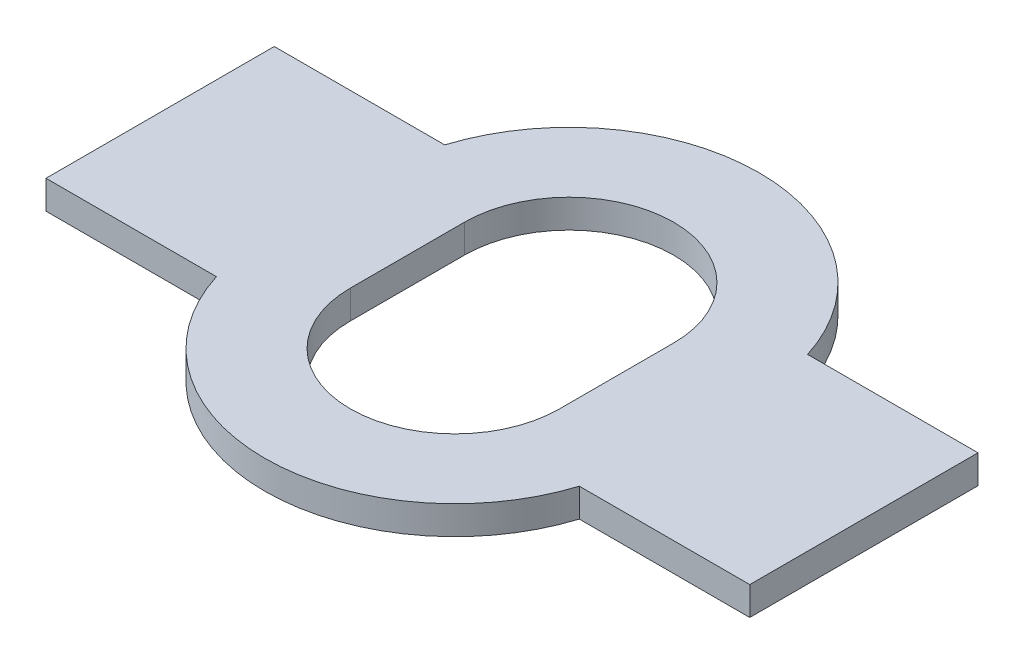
from build123d import *

# Parameters (mm, degrees)
EXTRUDE1_DEPTH = 3


with BuildPart() as part:
    # Sketch1 → Extrude1 (new body)
    with BuildSketch(Plane(origin=(0, 0, 0), x_dir=(1, 0, 0), z_dir=(0, 1, 0))):
        with BuildLine():
            Line((37, 12), (19.078784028, 12))
            ThreePointArc((19.078784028, 12), (0, 26), (-19.078784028, 12))
            Line((-19.078784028, 12), (-37, 12))
            Line((-37, 12), (-37, -12))
            Line((-37, -12), (-19.078784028, -12))
            ThreePointArc((-19.078784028, -12), (0, -26), (19.078784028, -12))
            Line((19.078784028, -12), (37, -12))
            Line((37, -12), (37, 12))
        make_face()
        with BuildLine():
            Line((11, 6), (11, -6))
            ThreePointArc((11, -6), (0, -17), (-11, -6))
            Line((-11, -6), (-11, 6))
            ThreePointArc((-11, 6), (0, 17), (11, 6))
        make_face(mode=Mode.SUBTRACT)
    extrude(amount=EXTRUDE1_DEPTH)


solid = part.part
